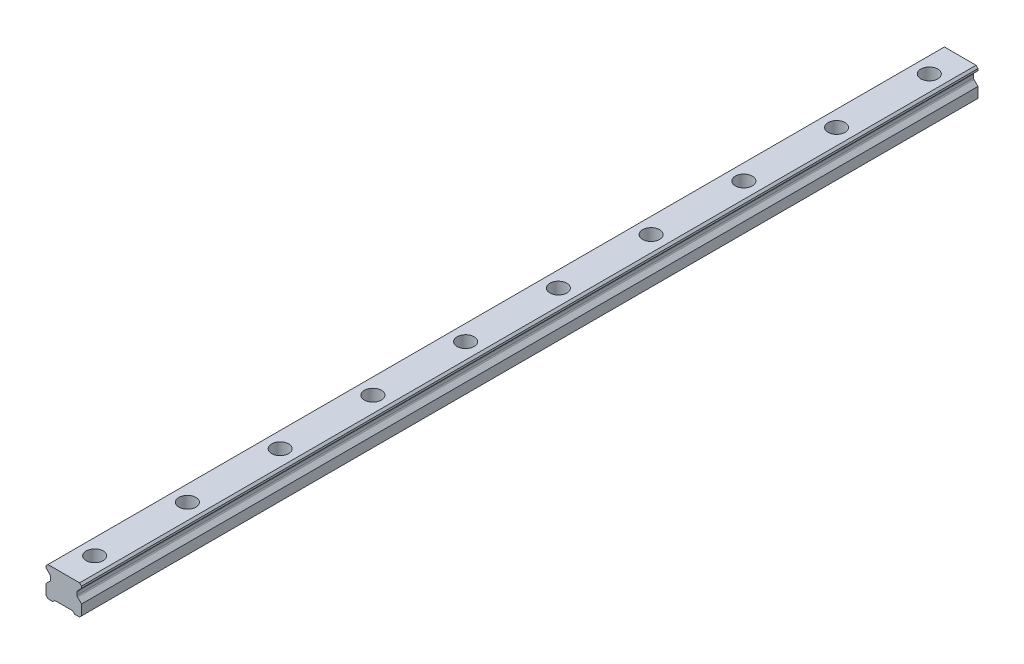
from build123d import *

# Parameters (mm, degrees)
SKETCH1_W           = 23
SKETCH1_H           = 19.2
BOSS_EXTRUDE1_DEPTH = 290
CUT_EXTRUDE1_DEPTH  = 581.431641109
CHAMFER1_SIZE       = 1.25
FILLET1_R           = 1.25
CUT_EXTRUDE2_DEPTH  = 581.431641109
SKETCH4_R           = 5.5
SKETCH4_R_2         = 3.5
CUT_EXTRUDE3_DEPTH  = 9
SKETCH4_2_R         = 3.5
CUT_EXTRUDE4_DEPTH  = 291.862321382
LPATTERN1_COUNT     = 10
LPATTERN1_PITCH     = 60


with BuildPart() as part:
    # Sketch1 → Boss-Extrude1 (new, symmetric)
    with BuildSketch(Plane.XY):
        with Locations((0, 9.6)):
            Rectangle(SKETCH1_W, SKETCH1_H)
    extrude(amount=BOSS_EXTRUDE1_DEPTH, both=True)

    # Sketch2 → Cut-Extrude1 (cut, through all)
    with BuildSketch(Plane.XY.offset(290)):
        Polygon((-11.5, 16.7), (-11.5, 7.95), (-8.583333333, 10.866666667), (-8.583333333, 13.783333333), align=None)
        Polygon((8.583333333, 13.783333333), (11.5, 16.7), (11.5, 7.95), (8.583333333, 10.866666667), align=None)
    extrude(amount=-CUT_EXTRUDE1_DEPTH, mode=Mode.SUBTRACT)

    # Chamfer1
    chamfer1_edges = [part.edges().sort_by_distance(p)[0] for p in [
        (-11.5, 19.2, 0),
        (11.5, 19.2, 0),
        (11.5, 0, 0),
        (-11.5, 0, 0),
    ]]
    chamfer(chamfer1_edges, length=CHAMFER1_SIZE)

    # Fillet1
    fillet1_edges = [part.edges().sort_by_distance(p)[0] for p in [
        (-8.583333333, 13.783333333, 0),
        (-8.583333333, 10.866666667, 0),
        (8.583333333, 10.866666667, 0),
        (8.583333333, 13.783333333, 0),
    ]]
    fillet(fillet1_edges, radius=FILLET1_R)

    # Sketch3 → Cut-Extrude2 (cut, through all)
    with BuildSketch(Plane.XY.offset(290)):
        Polygon((-7, 0), (-5.75, 1.25), (5.75, 1.25), (7, 0), align=None)
    extrude(amount=-CUT_EXTRUDE2_DEPTH, mode=Mode.SUBTRACT)

    # Sketch4 → Cut-Extrude3 (cut)
    with BuildSketch(Plane(origin=(0, 19.2, 0), x_dir=(1, 0, 0), z_dir=(0, 1, 0))):
        with Locations(Location((0, -270, 0), (0, 0, 270))):
            Circle(SKETCH4_R)
        with Locations(Location((0, -270, 0), (0, 0, 270))):
            Circle(SKETCH4_R_2, mode=Mode.SUBTRACT)
    cut_extrude3 = extrude(amount=-CUT_EXTRUDE3_DEPTH, mode=Mode.SUBTRACT)

    # Sketch4_2 → Cut-Extrude4 (cut, through all)
    with BuildSketch(Plane(origin=(0, 19.2, 0), x_dir=(1, 0, 0), z_dir=(0, 1, 0))):
        with Locations(Location((0, -270, 0), (0, 0, 270))):
            Circle(SKETCH4_2_R)
    cut_extrude4 = extrude(amount=-CUT_EXTRUDE4_DEPTH, mode=Mode.SUBTRACT)

    # LPattern1: Cut-Extrude3, Cut-Extrude4 ×10
    with Locations(*[(0, 0, -i * LPATTERN1_PITCH) for i in range(1, LPATTERN1_COUNT)]):
        add(cut_extrude3, mode=Mode.SUBTRACT)
        add(cut_extrude4, mode=Mode.SUBTRACT)


solid = part.part
